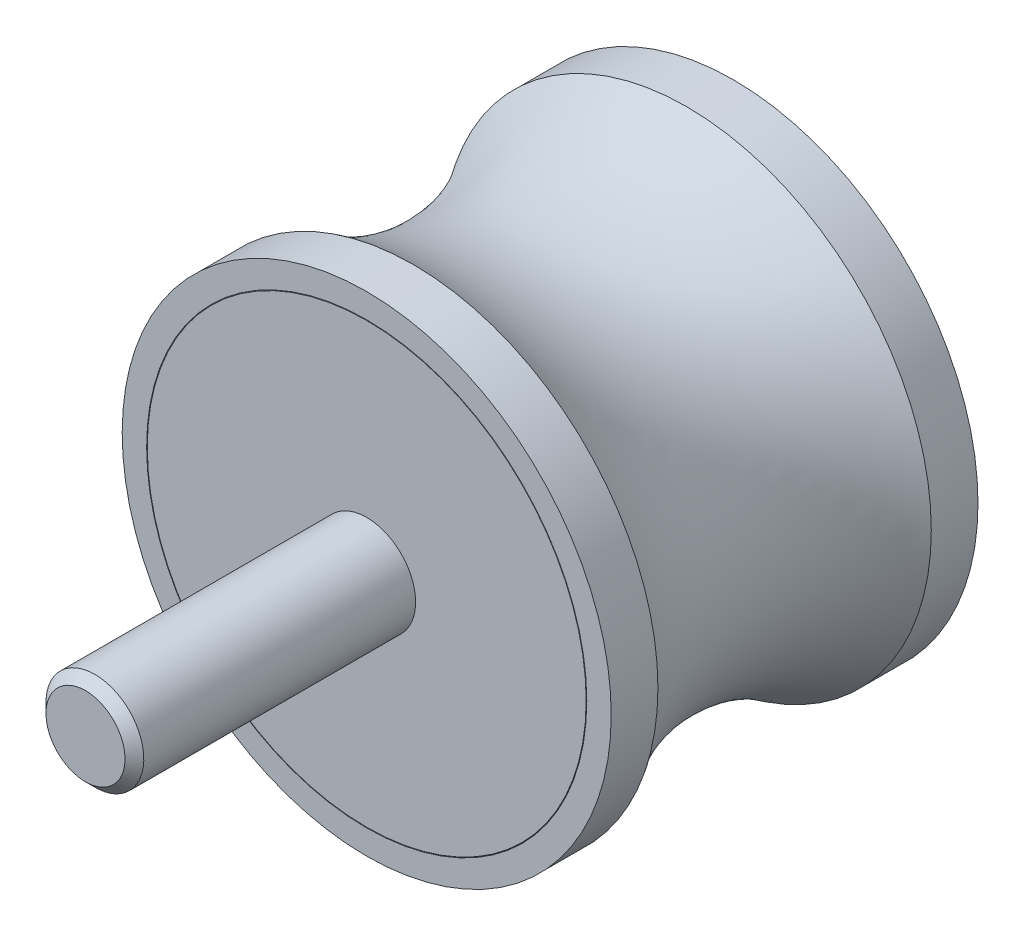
ISO-10303-21;
HEADER;
FILE_DESCRIPTION(('STEP AP214'),'2;1');
FILE_NAME('part.step','',(''),(''),'','','');
FILE_SCHEMA(('AUTOMOTIVE_DESIGN { 1 0 10303 214 1 1 1 1 }'));
ENDSEC;
DATA;
#1=APPLICATION_CONTEXT('core data for automotive mechanical design processes');
#2=APPLICATION_PROTOCOL_DEFINITION('international standard','automotive_design',2000,#1);
#3=PRODUCT_CONTEXT('',#1,'mechanical');
#4=PRODUCT('Part','Part','',(#3));
#5=PRODUCT_RELATED_PRODUCT_CATEGORY('part','',(#4));
#6=PRODUCT_DEFINITION_FORMATION('','',#4);
#7=PRODUCT_DEFINITION_CONTEXT('part definition',#1,'design');
#8=PRODUCT_DEFINITION('design','',#6,#7);
#9=PRODUCT_DEFINITION_SHAPE('','',#8);
#10=(LENGTH_UNIT() NAMED_UNIT(*) SI_UNIT(.MILLI.,.METRE.));
#11=(NAMED_UNIT(*) PLANE_ANGLE_UNIT() SI_UNIT($,.RADIAN.));
#12=(NAMED_UNIT(*) SI_UNIT($,.STERADIAN.) SOLID_ANGLE_UNIT());
#13=UNCERTAINTY_MEASURE_WITH_UNIT(LENGTH_MEASURE(1.E-05),#10,'distance_accuracy_value','');
#14=(GEOMETRIC_REPRESENTATION_CONTEXT(3) GLOBAL_UNCERTAINTY_ASSIGNED_CONTEXT((#13)) GLOBAL_UNIT_ASSIGNED_CONTEXT((#10,
#11,#12)) REPRESENTATION_CONTEXT('',''));
#15=CARTESIAN_POINT('',(0.,0.,0.));
#16=DIRECTION('',(0.,0.,1.));
#17=DIRECTION('',(1.,0.,0.));
#18=AXIS2_PLACEMENT_3D('',#15,#16,#17);
#19=CARTESIAN_POINT('',(0.,0.,0.5));
#20=DIRECTION('',(0.,0.,-1.));
#21=DIRECTION('',(0.,1.,0.));
#22=AXIS2_PLACEMENT_3D('',#19,#20,#21);
#23=CYLINDRICAL_SURFACE('',#22,18.);
#24=CARTESIAN_POINT('',(0.,0.,0.05));
#25=DIRECTION('',(0.,0.,-1.));
#26=DIRECTION('',(0.,1.,0.));
#27=AXIS2_PLACEMENT_3D('',#24,#25,#26);
#28=CIRCLE('',#27,18.);
#29=CARTESIAN_POINT('',(0.,18.,0.05));
#30=VERTEX_POINT('',#29);
#31=EDGE_CURVE('E53',#30,#30,#28,.T.);
#32=ORIENTED_EDGE('',*,*,#31,.F.);
#33=EDGE_LOOP('',(#32));
#34=FACE_BOUND('',#33,.T.);
#35=CARTESIAN_POINT('',(0.,0.,0.));
#36=DIRECTION('',(0.,0.,-1.));
#37=DIRECTION('',(0.,1.,0.));
#38=AXIS2_PLACEMENT_3D('',#35,#36,#37);
#39=CIRCLE('',#38,18.);
#40=CARTESIAN_POINT('',(0.,18.,0.));
#41=VERTEX_POINT('',#40);
#42=EDGE_CURVE('E44',#41,#41,#39,.T.);
#43=ORIENTED_EDGE('',*,*,#42,.T.);
#44=EDGE_LOOP('',(#43));
#45=FACE_BOUND('',#44,.T.);
#46=ADVANCED_FACE('F12',(#34,#45),#23,.F.);
#47=CARTESIAN_POINT('',(0.,0.,0.5));
#48=DIRECTION('',(0.,0.,-1.));
#49=DIRECTION('',(0.,1.,0.));
#50=AXIS2_PLACEMENT_3D('',#47,#48,#49);
#51=CYLINDRICAL_SURFACE('',#50,18.);
#52=CARTESIAN_POINT('',(0.,0.,30.));
#53=DIRECTION('',(0.,0.,-1.));
#54=DIRECTION('',(0.,1.,0.));
#55=AXIS2_PLACEMENT_3D('',#52,#53,#54);
#56=CIRCLE('',#55,18.);
#57=CARTESIAN_POINT('',(0.,18.,30.));
#58=VERTEX_POINT('',#57);
#59=EDGE_CURVE('E27',#58,#58,#56,.T.);
#60=ORIENTED_EDGE('',*,*,#59,.F.);
#61=EDGE_LOOP('',(#60));
#62=FACE_BOUND('',#61,.T.);
#63=CARTESIAN_POINT('',(0.,0.,29.95));
#64=DIRECTION('',(0.,0.,-1.));
#65=DIRECTION('',(0.,1.,0.));
#66=AXIS2_PLACEMENT_3D('',#63,#64,#65);
#67=CIRCLE('',#66,18.);
#68=CARTESIAN_POINT('',(0.,18.,29.95));
#69=VERTEX_POINT('',#68);
#70=EDGE_CURVE('E50',#69,#69,#67,.T.);
#71=ORIENTED_EDGE('',*,*,#70,.T.);
#72=EDGE_LOOP('',(#71));
#73=FACE_BOUND('',#72,.T.);
#74=ADVANCED_FACE('F89',(#62,#73),#51,.F.);
#75=CARTESIAN_POINT('',(18.,0.,30.));
#76=DIRECTION('',(0.,0.,-1.));
#77=DIRECTION('',(0.,1.,0.));
#78=AXIS2_PLACEMENT_3D('',#75,#76,#77);
#79=PLANE('',#78);
#80=CARTESIAN_POINT('',(0.,0.,30.));
#81=DIRECTION('',(0.,0.,-1.));
#82=DIRECTION('',(0.,1.,0.));
#83=AXIS2_PLACEMENT_3D('',#80,#81,#82);
#84=CIRCLE('',#83,20.);
#85=CARTESIAN_POINT('',(0.,20.,30.));
#86=VERTEX_POINT('',#85);
#87=EDGE_CURVE('E32',#86,#86,#84,.T.);
#88=ORIENTED_EDGE('',*,*,#87,.F.);
#89=EDGE_LOOP('',(#88));
#90=FACE_BOUND('',#89,.T.);
#91=ORIENTED_EDGE('',*,*,#59,.T.);
#92=EDGE_LOOP('',(#91));
#93=FACE_BOUND('',#92,.T.);
#94=ADVANCED_FACE('F115',(#90,#93),#79,.F.);
#95=CARTESIAN_POINT('',(0.,0.,0.5));
#96=DIRECTION('',(0.,0.,-1.));
#97=DIRECTION('',(0.,1.,0.));
#98=AXIS2_PLACEMENT_3D('',#95,#96,#97);
#99=CYLINDRICAL_SURFACE('',#98,20.);
#100=CARTESIAN_POINT('',(0.,0.,26.1803398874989));
#101=DIRECTION('',(0.,0.,-1.));
#102=DIRECTION('',(0.,1.,0.));
#103=AXIS2_PLACEMENT_3D('',#100,#101,#102);
#104=CIRCLE('',#103,20.);
#105=CARTESIAN_POINT('',(0.,20.,26.1803398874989));
#106=VERTEX_POINT('',#105);
#107=EDGE_CURVE('E35',#106,#106,#104,.T.);
#108=ORIENTED_EDGE('',*,*,#107,.F.);
#109=EDGE_LOOP('',(#108));
#110=FACE_BOUND('',#109,.T.);
#111=ORIENTED_EDGE('',*,*,#87,.T.);
#112=EDGE_LOOP('',(#111));
#113=FACE_BOUND('',#112,.T.);
#114=ADVANCED_FACE('F109',(#110,#113),#99,.T.);
#115=CARTESIAN_POINT('',(0.,0.,15.));
#116=DIRECTION('',(0.,0.,-1.));
#117=DIRECTION('',(0.,1.,0.));
#118=AXIS2_PLACEMENT_3D('',#115,#116,#117);
#119=TOROIDAL_SURFACE('',#118,36.1071428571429,19.6071428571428);
#120=CARTESIAN_POINT('',(0.,0.,3.81966011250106));
#121=DIRECTION('',(0.,0.,-1.));
#122=DIRECTION('',(0.,1.,0.));
#123=AXIS2_PLACEMENT_3D('',#120,#121,#122);
#124=CIRCLE('',#123,20.);
#125=CARTESIAN_POINT('',(0.,20.,3.81966011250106));
#126=VERTEX_POINT('',#125);
#127=EDGE_CURVE('E38',#126,#126,#124,.T.);
#128=ORIENTED_EDGE('',*,*,#127,.F.);
#129=EDGE_LOOP('',(#128));
#130=FACE_BOUND('',#129,.T.);
#131=ORIENTED_EDGE('',*,*,#107,.T.);
#132=EDGE_LOOP('',(#131));
#133=FACE_BOUND('',#132,.T.);
#134=ADVANCED_FACE('F103',(#130,#133),#119,.F.);
#135=CARTESIAN_POINT('',(0.,0.,0.5));
#136=DIRECTION('',(0.,0.,-1.));
#137=DIRECTION('',(0.,1.,0.));
#138=AXIS2_PLACEMENT_3D('',#135,#136,#137);
#139=CYLINDRICAL_SURFACE('',#138,20.);
#140=CARTESIAN_POINT('',(0.,0.,0.));
#141=DIRECTION('',(0.,0.,-1.));
#142=DIRECTION('',(0.,1.,0.));
#143=AXIS2_PLACEMENT_3D('',#140,#141,#142);
#144=CIRCLE('',#143,20.);
#145=CARTESIAN_POINT('',(0.,20.,0.));
#146=VERTEX_POINT('',#145);
#147=EDGE_CURVE('E41',#146,#146,#144,.T.);
#148=ORIENTED_EDGE('',*,*,#147,.F.);
#149=EDGE_LOOP('',(#148));
#150=FACE_BOUND('',#149,.T.);
#151=ORIENTED_EDGE('',*,*,#127,.T.);
#152=EDGE_LOOP('',(#151));
#153=FACE_BOUND('',#152,.T.);
#154=ADVANCED_FACE('F97',(#150,#153),#139,.T.);
#155=CARTESIAN_POINT('',(20.,0.,0.));
#156=DIRECTION('',(0.,0.,1.));
#157=DIRECTION('',(0.,-1.,0.));
#158=AXIS2_PLACEMENT_3D('',#155,#156,#157);
#159=PLANE('',#158);
#160=ORIENTED_EDGE('',*,*,#42,.F.);
#161=EDGE_LOOP('',(#160));
#162=FACE_BOUND('',#161,.T.);
#163=ORIENTED_EDGE('',*,*,#147,.T.);
#164=EDGE_LOOP('',(#163));
#165=FACE_BOUND('',#164,.T.);
#166=ADVANCED_FACE('F93',(#162,#165),#159,.F.);
#167=CARTESIAN_POINT('',(0.,0.,30.));
#168=DIRECTION('',(0.,0.,-1.));
#169=DIRECTION('',(0.,1.,0.));
#170=AXIS2_PLACEMENT_3D('',#167,#168,#169);
#171=PLANE('',#170);
#172=CARTESIAN_POINT('',(0.,0.,30.));
#173=DIRECTION('',(0.,0.,-1.));
#174=DIRECTION('',(0.,1.,0.));
#175=AXIS2_PLACEMENT_3D('',#172,#173,#174);
#176=CIRCLE('',#175,17.95);
#177=CARTESIAN_POINT('',(0.,17.95,30.));
#178=VERTEX_POINT('',#177);
#179=EDGE_CURVE('E47',#178,#178,#176,.T.);
#180=ORIENTED_EDGE('',*,*,#179,.F.);
#181=EDGE_LOOP('',(#180));
#182=FACE_BOUND('',#181,.T.);
#183=CARTESIAN_POINT('',(0.,0.,30.));
#184=DIRECTION('',(0.,0.,-1.));
#185=DIRECTION('',(0.,1.,0.));
#186=AXIS2_PLACEMENT_3D('',#183,#184,#185);
#187=CIRCLE('',#186,4.);
#188=CARTESIAN_POINT('',(0.,4.,30.));
#189=VERTEX_POINT('',#188);
#190=EDGE_CURVE('E8',#189,#189,#187,.T.);
#191=ORIENTED_EDGE('',*,*,#190,.T.);
#192=EDGE_LOOP('',(#191));
#193=FACE_BOUND('',#192,.T.);
#194=ADVANCED_FACE('F96',(#182,#193),#171,.F.);
#195=CARTESIAN_POINT('',(0.,0.,30.));
#196=DIRECTION('',(0.,0.,-1.));
#197=DIRECTION('',(0.,1.,0.));
#198=AXIS2_PLACEMENT_3D('',#195,#196,#197);
#199=CONICAL_SURFACE('',#198,17.95,0.785398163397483);
#200=ORIENTED_EDGE('',*,*,#70,.F.);
#201=EDGE_LOOP('',(#200));
#202=FACE_BOUND('',#201,.T.);
#203=ORIENTED_EDGE('',*,*,#179,.T.);
#204=EDGE_LOOP('',(#203));
#205=FACE_BOUND('',#204,.T.);
#206=ADVANCED_FACE('F129',(#202,#205),#199,.T.);
#207=CARTESIAN_POINT('',(0.,0.,53.));
#208=DIRECTION('',(0.,0.,-1.));
#209=DIRECTION('',(0.,1.,0.));
#210=AXIS2_PLACEMENT_3D('',#207,#208,#209);
#211=PLANE('',#210);
#212=CARTESIAN_POINT('',(0.,0.,53.));
#213=DIRECTION('',(0.,0.,-1.));
#214=DIRECTION('',(0.,1.,0.));
#215=AXIS2_PLACEMENT_3D('',#212,#213,#214);
#216=CIRCLE('',#215,3.233);
#217=CARTESIAN_POINT('',(0.,3.233,53.));
#218=VERTEX_POINT('',#217);
#219=EDGE_CURVE('E19',#218,#218,#216,.T.);
#220=ORIENTED_EDGE('',*,*,#219,.F.);
#221=EDGE_LOOP('',(#220));
#222=FACE_BOUND('',#221,.T.);
#223=ADVANCED_FACE('F14',(#222),#211,.F.);
#224=CARTESIAN_POINT('',(0.,0.,53.));
#225=DIRECTION('',(0.,0.,-1.));
#226=DIRECTION('',(0.,1.,0.));
#227=AXIS2_PLACEMENT_3D('',#224,#225,#226);
#228=CONICAL_SURFACE('',#227,3.233,0.785398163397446);
#229=CARTESIAN_POINT('',(0.,0.,52.233));
#230=DIRECTION('',(0.,0.,-1.));
#231=DIRECTION('',(0.,1.,0.));
#232=AXIS2_PLACEMENT_3D('',#229,#230,#231);
#233=CIRCLE('',#232,4.);
#234=CARTESIAN_POINT('',(0.,4.,52.233));
#235=VERTEX_POINT('',#234);
#236=EDGE_CURVE('E23',#235,#235,#233,.T.);
#237=ORIENTED_EDGE('',*,*,#236,.F.);
#238=EDGE_LOOP('',(#237));
#239=FACE_BOUND('',#238,.T.);
#240=ORIENTED_EDGE('',*,*,#219,.T.);
#241=EDGE_LOOP('',(#240));
#242=FACE_BOUND('',#241,.T.);
#243=ADVANCED_FACE('F142',(#239,#242),#228,.T.);
#244=CARTESIAN_POINT('',(0.,0.,0.5));
#245=DIRECTION('',(0.,0.,-1.));
#246=DIRECTION('',(0.,1.,0.));
#247=AXIS2_PLACEMENT_3D('',#244,#245,#246);
#248=CYLINDRICAL_SURFACE('',#247,4.);
#249=ORIENTED_EDGE('',*,*,#190,.F.);
#250=EDGE_LOOP('',(#249));
#251=FACE_BOUND('',#250,.T.);
#252=ORIENTED_EDGE('',*,*,#236,.T.);
#253=EDGE_LOOP('',(#252));
#254=FACE_BOUND('',#253,.T.);
#255=ADVANCED_FACE('F83',(#251,#254),#248,.T.);
#256=CARTESIAN_POINT('',(0.,0.,0.05));
#257=DIRECTION('',(0.,0.,1.));
#258=DIRECTION('',(0.,-1.,0.));
#259=AXIS2_PLACEMENT_3D('',#256,#257,#258);
#260=CONICAL_SURFACE('',#259,18.,0.785398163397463);
#261=CARTESIAN_POINT('',(0.,0.,0.));
#262=DIRECTION('',(0.,0.,-1.));
#263=DIRECTION('',(0.,1.,0.));
#264=AXIS2_PLACEMENT_3D('',#261,#262,#263);
#265=CIRCLE('',#264,17.95);
#266=CARTESIAN_POINT('',(0.,17.95,0.));
#267=VERTEX_POINT('',#266);
#268=EDGE_CURVE('E56',#267,#267,#265,.T.);
#269=ORIENTED_EDGE('',*,*,#268,.F.);
#270=EDGE_LOOP('',(#269));
#271=FACE_BOUND('',#270,.T.);
#272=ORIENTED_EDGE('',*,*,#31,.T.);
#273=EDGE_LOOP('',(#272));
#274=FACE_BOUND('',#273,.T.);
#275=ADVANCED_FACE('F77',(#271,#274),#260,.T.);
#276=CARTESIAN_POINT('',(17.95,0.,0.));
#277=DIRECTION('',(0.,0.,1.));
#278=DIRECTION('',(0.,-1.,0.));
#279=AXIS2_PLACEMENT_3D('',#276,#277,#278);
#280=PLANE('',#279);
#281=CARTESIAN_POINT('',(0.,0.,0.));
#282=DIRECTION('',(0.,0.,-1.));
#283=DIRECTION('',(0.,1.,0.));
#284=AXIS2_PLACEMENT_3D('',#281,#282,#283);
#285=CIRCLE('',#284,4.);
#286=CARTESIAN_POINT('',(0.,4.,0.));
#287=VERTEX_POINT('',#286);
#288=EDGE_CURVE('E60',#287,#287,#285,.T.);
#289=ORIENTED_EDGE('',*,*,#288,.F.);
#290=EDGE_LOOP('',(#289));
#291=FACE_BOUND('',#290,.T.);
#292=ORIENTED_EDGE('',*,*,#268,.T.);
#293=EDGE_LOOP('',(#292));
#294=FACE_BOUND('',#293,.T.);
#295=ADVANCED_FACE('F71',(#291,#294),#280,.F.);
#296=CARTESIAN_POINT('',(0.,0.,8.));
#297=DIRECTION('',(0.,0.,-1.));
#298=DIRECTION('',(0.,1.,0.));
#299=AXIS2_PLACEMENT_3D('',#296,#297,#298);
#300=CYLINDRICAL_SURFACE('',#299,4.);
#301=CARTESIAN_POINT('',(0.,0.,8.));
#302=DIRECTION('',(0.,0.,-1.));
#303=DIRECTION('',(0.,1.,0.));
#304=AXIS2_PLACEMENT_3D('',#301,#302,#303);
#305=CIRCLE('',#304,4.);
#306=CARTESIAN_POINT('',(0.,4.,8.));
#307=VERTEX_POINT('',#306);
#308=EDGE_CURVE('E59',#307,#307,#305,.T.);
#309=ORIENTED_EDGE('',*,*,#308,.F.);
#310=EDGE_LOOP('',(#309));
#311=FACE_BOUND('',#310,.T.);
#312=ORIENTED_EDGE('',*,*,#288,.T.);
#313=EDGE_LOOP('',(#312));
#314=FACE_BOUND('',#313,.T.);
#315=ADVANCED_FACE('F68',(#311,#314),#300,.F.);
#316=CARTESIAN_POINT('',(0.,0.,8.));
#317=DIRECTION('',(0.,0.,-1.));
#318=DIRECTION('',(0.,1.,0.));
#319=AXIS2_PLACEMENT_3D('',#316,#317,#318);
#320=PLANE('',#319);
#321=ORIENTED_EDGE('',*,*,#308,.T.);
#322=EDGE_LOOP('',(#321));
#323=FACE_BOUND('',#322,.T.);
#324=ADVANCED_FACE('F66',(#323),#320,.T.);
#325=CLOSED_SHELL('',(#46,#74,#94,#114,#134,#154,#166,#194,#206,#223,#243,#255,#275,#295,#315,#324));
#326=MANIFOLD_SOLID_BREP('B1',#325);
#327=ADVANCED_BREP_SHAPE_REPRESENTATION('',(#18,#326),#14);
#328=SHAPE_DEFINITION_REPRESENTATION(#9,#327);
ENDSEC;
END-ISO-10303-21;
